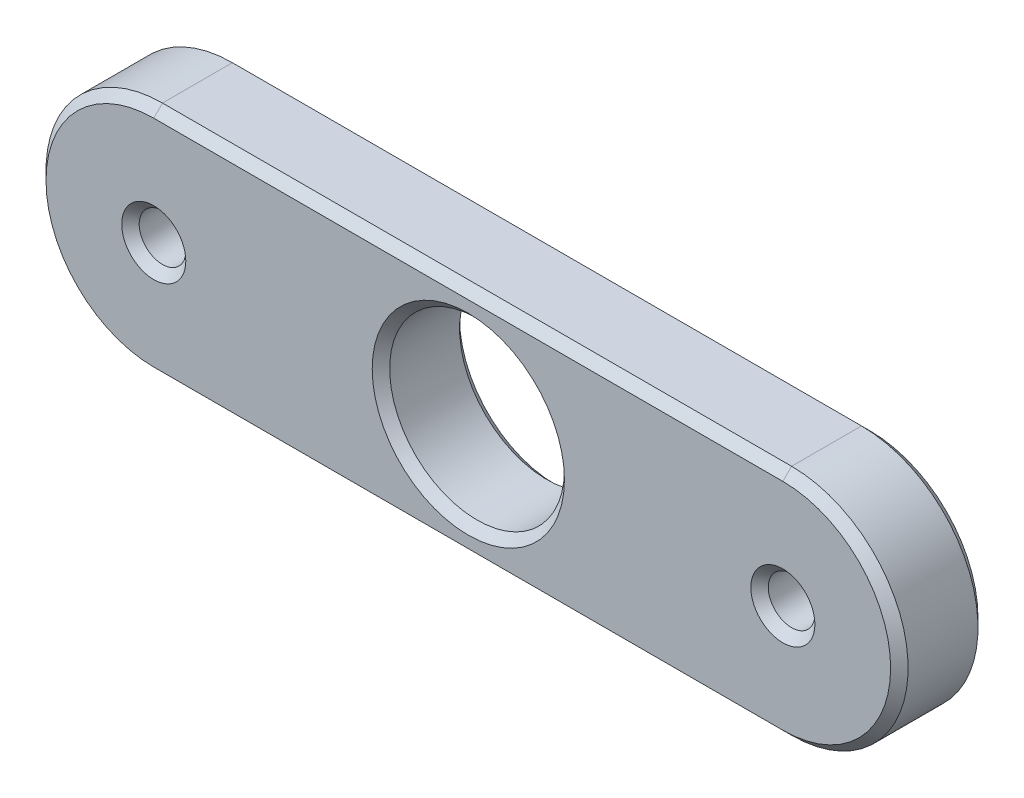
from build123d import *

# Parameters (mm, degrees)
ESQUISSE1_R        = 2
ESQUISSE1_R_2      = 7.5
BOSS_EXTRU_1_DEPTH = 7.5
CHANFREIN1_SIZE    = 0.75


with BuildPart() as part:
    # Esquisse1 → Boss.-Extru.1 (new body)
    with BuildSketch(Plane.XY):
        with BuildLine():
            Line((27, -10), (-27, -10))
            ThreePointArc((-27, -10), (-37, 0), (-27, 10))
            Line((-27, 10), (27, 10))
            ThreePointArc((27, 10), (37, 0), (27, -10))
        make_face()
        with Locations((-27, 0)):
            Circle(ESQUISSE1_R, mode=Mode.SUBTRACT)
        with Locations((27, 0)):
            Circle(ESQUISSE1_R, mode=Mode.SUBTRACT)
        Circle(ESQUISSE1_R_2, mode=Mode.SUBTRACT)
    extrude(amount=BOSS_EXTRU_1_DEPTH)

    # Chanfrein1
    chanfrein1_edges = [part.edges().sort_by_distance(p)[0] for p in [
        (-37, 0, 7.5),
        (-29, 0, 0),
        (-29, 0, 7.5),
        (0, -10, 7.5),
        (25, 0, 0),
        (25, 0, 7.5),
        (-7.5, 0, 0),
        (-7.5, 0, 7.5),
        (37, 0, 7.5),
        (0, -10, 0),
        (-37, 0, 0),
        (0, 10, 0),
        (37, 0, 0),
        (0, 10, 7.5),
    ]]
    chamfer(chanfrein1_edges, length=CHANFREIN1_SIZE)


solid = part.part
